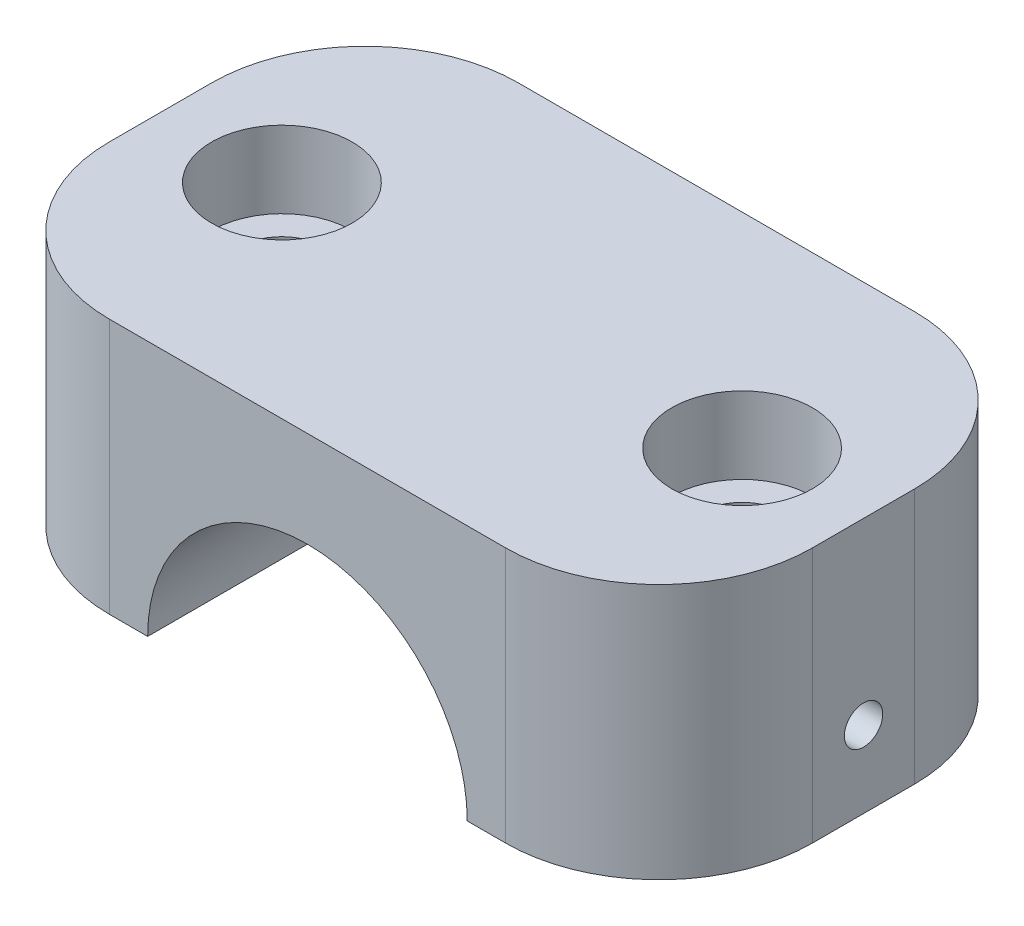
ISO-10303-21;
HEADER;
FILE_DESCRIPTION(('STEP AP214'),'2;1');
FILE_NAME('part.step','',(''),(''),'','','');
FILE_SCHEMA(('AUTOMOTIVE_DESIGN { 1 0 10303 214 1 1 1 1 }'));
ENDSEC;
DATA;
#1=APPLICATION_CONTEXT('core data for automotive mechanical design processes');
#2=APPLICATION_PROTOCOL_DEFINITION('international standard','automotive_design',2000,#1);
#3=PRODUCT_CONTEXT('',#1,'mechanical');
#4=PRODUCT('Part','Part','',(#3));
#5=PRODUCT_RELATED_PRODUCT_CATEGORY('part','',(#4));
#6=PRODUCT_DEFINITION_FORMATION('','',#4);
#7=PRODUCT_DEFINITION_CONTEXT('part definition',#1,'design');
#8=PRODUCT_DEFINITION('design','',#6,#7);
#9=PRODUCT_DEFINITION_SHAPE('','',#8);
#10=(LENGTH_UNIT() NAMED_UNIT(*) SI_UNIT(.MILLI.,.METRE.));
#11=(NAMED_UNIT(*) PLANE_ANGLE_UNIT() SI_UNIT($,.RADIAN.));
#12=(NAMED_UNIT(*) SI_UNIT($,.STERADIAN.) SOLID_ANGLE_UNIT());
#13=UNCERTAINTY_MEASURE_WITH_UNIT(LENGTH_MEASURE(1.E-05),#10,'distance_accuracy_value','');
#14=(GEOMETRIC_REPRESENTATION_CONTEXT(3) GLOBAL_UNCERTAINTY_ASSIGNED_CONTEXT((#13)) GLOBAL_UNIT_ASSIGNED_CONTEXT((#10,
#11,#12)) REPRESENTATION_CONTEXT('',''));
#15=CARTESIAN_POINT('',(0.,0.,0.));
#16=DIRECTION('',(0.,0.,1.));
#17=DIRECTION('',(1.,0.,0.));
#18=AXIS2_PLACEMENT_3D('',#15,#16,#17);
#19=CARTESIAN_POINT('',(-27.5,20.,16.));
#20=DIRECTION('',(0.,-1.,0.));
#21=DIRECTION('',(0.,0.,-1.));
#22=AXIS2_PLACEMENT_3D('',#19,#20,#21);
#23=PLANE('',#22);
#24=DIRECTION('',(-1.,0.,0.));
#25=VECTOR('',#24,1.);
#26=CARTESIAN_POINT('',(-27.5,20.,16.));
#27=LINE('',#26,#25);
#28=CARTESIAN_POINT('',(15.5,20.,16.));
#29=VERTEX_POINT('',#28);
#30=CARTESIAN_POINT('',(-15.5,20.,16.));
#31=VERTEX_POINT('',#30);
#32=EDGE_CURVE('E180',#29,#31,#27,.T.);
#33=ORIENTED_EDGE('',*,*,#32,.F.);
#34=CARTESIAN_POINT('',(15.5,20.,4.));
#35=DIRECTION('',(0.,-1.,0.));
#36=DIRECTION('',(0.,0.,-1.));
#37=AXIS2_PLACEMENT_3D('',#34,#35,#36);
#38=CIRCLE('',#37,12.);
#39=CARTESIAN_POINT('',(27.5,20.,4.));
#40=VERTEX_POINT('',#39);
#41=EDGE_CURVE('E209',#29,#40,#38,.F.);
#42=ORIENTED_EDGE('',*,*,#41,.T.);
#43=DIRECTION('',(0.,0.,-1.));
#44=VECTOR('',#43,1.);
#45=CARTESIAN_POINT('',(27.5,20.,16.));
#46=LINE('',#45,#44);
#47=CARTESIAN_POINT('',(27.5,20.,-4.));
#48=VERTEX_POINT('',#47);
#49=EDGE_CURVE('E186',#40,#48,#46,.T.);
#50=ORIENTED_EDGE('',*,*,#49,.T.);
#51=CARTESIAN_POINT('',(15.5,20.,-4.));
#52=DIRECTION('',(0.,-1.,0.));
#53=DIRECTION('',(0.,0.,-1.));
#54=AXIS2_PLACEMENT_3D('',#51,#52,#53);
#55=CIRCLE('',#54,12.);
#56=CARTESIAN_POINT('',(15.5,20.,-16.));
#57=VERTEX_POINT('',#56);
#58=EDGE_CURVE('E203',#48,#57,#55,.F.);
#59=ORIENTED_EDGE('',*,*,#58,.T.);
#60=DIRECTION('',(-1.,0.,0.));
#61=VECTOR('',#60,1.);
#62=CARTESIAN_POINT('',(-27.5,20.,-16.));
#63=LINE('',#62,#61);
#64=CARTESIAN_POINT('',(-15.5,20.,-16.));
#65=VERTEX_POINT('',#64);
#66=EDGE_CURVE('E174',#57,#65,#63,.T.);
#67=ORIENTED_EDGE('',*,*,#66,.T.);
#68=CARTESIAN_POINT('',(-15.5,20.,-4.));
#69=DIRECTION('',(0.,-1.,0.));
#70=DIRECTION('',(0.,0.,-1.));
#71=AXIS2_PLACEMENT_3D('',#68,#69,#70);
#72=CIRCLE('',#71,12.);
#73=CARTESIAN_POINT('',(-27.5,20.,-4.));
#74=VERTEX_POINT('',#73);
#75=EDGE_CURVE('E205',#65,#74,#72,.F.);
#76=ORIENTED_EDGE('',*,*,#75,.T.);
#77=DIRECTION('',(0.,0.,-1.));
#78=VECTOR('',#77,1.);
#79=CARTESIAN_POINT('',(-27.5,20.,16.));
#80=LINE('',#79,#78);
#81=CARTESIAN_POINT('',(-27.5,20.,4.));
#82=VERTEX_POINT('',#81);
#83=EDGE_CURVE('E183',#82,#74,#80,.T.);
#84=ORIENTED_EDGE('',*,*,#83,.F.);
#85=CARTESIAN_POINT('',(-15.5,20.,4.));
#86=DIRECTION('',(0.,-1.,0.));
#87=DIRECTION('',(0.,0.,-1.));
#88=AXIS2_PLACEMENT_3D('',#85,#86,#87);
#89=CIRCLE('',#88,12.);
#90=EDGE_CURVE('E207',#82,#31,#89,.F.);
#91=ORIENTED_EDGE('',*,*,#90,.T.);
#92=EDGE_LOOP('',(#33,#42,#50,#59,#67,#76,#84,#91));
#93=FACE_BOUND('',#92,.T.);
#94=CARTESIAN_POINT('',(-18.,20.,0.));
#95=DIRECTION('',(0.,1.,0.));
#96=DIRECTION('',(0.,0.,1.));
#97=AXIS2_PLACEMENT_3D('',#94,#95,#96);
#98=CIRCLE('',#97,5.49999999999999);
#99=CARTESIAN_POINT('',(-18.,20.,5.49999999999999));
#100=VERTEX_POINT('',#99);
#101=EDGE_CURVE('E159',#100,#100,#98,.T.);
#102=ORIENTED_EDGE('',*,*,#101,.F.);
#103=EDGE_LOOP('',(#102));
#104=FACE_BOUND('',#103,.T.);
#105=CARTESIAN_POINT('',(18.,20.,0.));
#106=DIRECTION('',(0.,1.,0.));
#107=DIRECTION('',(0.,0.,1.));
#108=AXIS2_PLACEMENT_3D('',#105,#106,#107);
#109=CIRCLE('',#108,5.49999999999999);
#110=CARTESIAN_POINT('',(18.,20.,5.49999999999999));
#111=VERTEX_POINT('',#110);
#112=EDGE_CURVE('E141',#111,#111,#109,.T.);
#113=ORIENTED_EDGE('',*,*,#112,.F.);
#114=EDGE_LOOP('',(#113));
#115=FACE_BOUND('',#114,.T.);
#116=ADVANCED_FACE('F38',(#93,#104,#115),#23,.F.);
#117=CARTESIAN_POINT('',(-27.5,0.,16.));
#118=DIRECTION('',(0.,1.,0.));
#119=DIRECTION('',(0.,0.,1.));
#120=AXIS2_PLACEMENT_3D('',#117,#118,#119);
#121=PLANE('',#120);
#122=CARTESIAN_POINT('',(18.,0.,0.));
#123=DIRECTION('',(0.,1.,0.));
#124=DIRECTION('',(0.,0.,1.));
#125=AXIS2_PLACEMENT_3D('',#122,#123,#124);
#126=CIRCLE('',#125,3.29999999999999);
#127=CARTESIAN_POINT('',(18.,0.,3.29999999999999));
#128=VERTEX_POINT('',#127);
#129=EDGE_CURVE('E130',#128,#128,#126,.T.);
#130=ORIENTED_EDGE('',*,*,#129,.T.);
#131=EDGE_LOOP('',(#130));
#132=FACE_BOUND('',#131,.T.);
#133=DIRECTION('',(0.,0.,-1.));
#134=VECTOR('',#133,1.);
#135=CARTESIAN_POINT('',(27.5,0.,16.));
#136=LINE('',#135,#134);
#137=CARTESIAN_POINT('',(27.5,0.,4.));
#138=VERTEX_POINT('',#137);
#139=CARTESIAN_POINT('',(27.5,0.,-4.));
#140=VERTEX_POINT('',#139);
#141=EDGE_CURVE('E189',#138,#140,#136,.T.);
#142=ORIENTED_EDGE('',*,*,#141,.F.);
#143=CARTESIAN_POINT('',(15.5,0.,4.));
#144=DIRECTION('',(0.,1.,0.));
#145=DIRECTION('',(0.,0.,1.));
#146=AXIS2_PLACEMENT_3D('',#143,#144,#145);
#147=CIRCLE('',#146,12.);
#148=CARTESIAN_POINT('',(15.5,0.,16.));
#149=VERTEX_POINT('',#148);
#150=EDGE_CURVE('E218',#138,#149,#147,.F.);
#151=ORIENTED_EDGE('',*,*,#150,.T.);
#152=DIRECTION('',(1.,0.,0.));
#153=VECTOR('',#152,1.);
#154=CARTESIAN_POINT('',(-27.5,0.,16.));
#155=LINE('',#154,#153);
#156=CARTESIAN_POINT('',(12.5,0.,16.));
#157=VERTEX_POINT('',#156);
#158=EDGE_CURVE('E177',#157,#149,#155,.T.);
#159=ORIENTED_EDGE('',*,*,#158,.F.);
#160=DIRECTION('',(0.,0.,-1.));
#161=VECTOR('',#160,1.);
#162=CARTESIAN_POINT('',(12.5,0.,139.376030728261));
#163=LINE('',#162,#161);
#164=CARTESIAN_POINT('',(12.5,0.,-16.));
#165=VERTEX_POINT('',#164);
#166=EDGE_CURVE('E162',#157,#165,#163,.T.);
#167=ORIENTED_EDGE('',*,*,#166,.T.);
#168=DIRECTION('',(1.,0.,0.));
#169=VECTOR('',#168,1.);
#170=CARTESIAN_POINT('',(-27.5,0.,-16.));
#171=LINE('',#170,#169);
#172=CARTESIAN_POINT('',(15.5,0.,-16.));
#173=VERTEX_POINT('',#172);
#174=EDGE_CURVE('E171',#165,#173,#171,.T.);
#175=ORIENTED_EDGE('',*,*,#174,.T.);
#176=CARTESIAN_POINT('',(15.5,0.,-4.));
#177=DIRECTION('',(0.,1.,0.));
#178=DIRECTION('',(0.,0.,1.));
#179=AXIS2_PLACEMENT_3D('',#176,#177,#178);
#180=CIRCLE('',#179,12.);
#181=EDGE_CURVE('E216',#173,#140,#180,.F.);
#182=ORIENTED_EDGE('',*,*,#181,.T.);
#183=EDGE_LOOP('',(#142,#151,#159,#167,#175,#182));
#184=FACE_BOUND('',#183,.T.);
#185=ADVANCED_FACE('F236',(#132,#184),#121,.F.);
#186=CARTESIAN_POINT('',(-18.,0.,0.));
#187=DIRECTION('',(0.,1.,0.));
#188=DIRECTION('',(0.,0.,1.));
#189=AXIS2_PLACEMENT_3D('',#186,#187,#188);
#190=CIRCLE('',#189,3.3);
#191=CARTESIAN_POINT('',(-18.,0.,3.3));
#192=VERTEX_POINT('',#191);
#193=EDGE_CURVE('E150',#192,#192,#190,.T.);
#194=ORIENTED_EDGE('',*,*,#193,.T.);
#195=EDGE_LOOP('',(#194));
#196=FACE_BOUND('',#195,.T.);
#197=CARTESIAN_POINT('',(-15.5,0.,16.));
#198=VERTEX_POINT('',#197);
#199=CARTESIAN_POINT('',(-12.5,0.,16.));
#200=VERTEX_POINT('',#199);
#201=EDGE_CURVE('E178',#198,#200,#155,.T.);
#202=ORIENTED_EDGE('',*,*,#201,.F.);
#203=CARTESIAN_POINT('',(-15.5,0.,4.));
#204=DIRECTION('',(0.,1.,0.));
#205=DIRECTION('',(0.,0.,1.));
#206=AXIS2_PLACEMENT_3D('',#203,#204,#205);
#207=CIRCLE('',#206,12.);
#208=CARTESIAN_POINT('',(-27.5,0.,4.));
#209=VERTEX_POINT('',#208);
#210=EDGE_CURVE('E221',#198,#209,#207,.F.);
#211=ORIENTED_EDGE('',*,*,#210,.T.);
#212=DIRECTION('',(0.,0.,-1.));
#213=VECTOR('',#212,1.);
#214=CARTESIAN_POINT('',(-27.5,0.,16.));
#215=LINE('',#214,#213);
#216=CARTESIAN_POINT('',(-27.5,0.,-4.));
#217=VERTEX_POINT('',#216);
#218=EDGE_CURVE('E192',#209,#217,#215,.T.);
#219=ORIENTED_EDGE('',*,*,#218,.T.);
#220=CARTESIAN_POINT('',(-15.5,0.,-4.));
#221=DIRECTION('',(0.,1.,0.));
#222=DIRECTION('',(0.,0.,1.));
#223=AXIS2_PLACEMENT_3D('',#220,#221,#222);
#224=CIRCLE('',#223,12.);
#225=CARTESIAN_POINT('',(-15.5,0.,-16.));
#226=VERTEX_POINT('',#225);
#227=EDGE_CURVE('E53',#217,#226,#224,.F.);
#228=ORIENTED_EDGE('',*,*,#227,.T.);
#229=CARTESIAN_POINT('',(-12.5,0.,-16.));
#230=VERTEX_POINT('',#229);
#231=EDGE_CURVE('E172',#226,#230,#171,.T.);
#232=ORIENTED_EDGE('',*,*,#231,.T.);
#233=DIRECTION('',(0.,0.,-1.));
#234=VECTOR('',#233,1.);
#235=CARTESIAN_POINT('',(-12.5,0.,139.376030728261));
#236=LINE('',#235,#234);
#237=EDGE_CURVE('E163',#200,#230,#236,.T.);
#238=ORIENTED_EDGE('',*,*,#237,.F.);
#239=EDGE_LOOP('',(#202,#211,#219,#228,#232,#238));
#240=FACE_BOUND('',#239,.T.);
#241=ADVANCED_FACE('F260',(#196,#240),#121,.F.);
#242=CARTESIAN_POINT('',(-27.5,20.,16.));
#243=DIRECTION('',(0.,0.,-1.));
#244=DIRECTION('',(-1.,0.,0.));
#245=AXIS2_PLACEMENT_3D('',#242,#243,#244);
#246=PLANE('',#245);
#247=ORIENTED_EDGE('',*,*,#158,.T.);
#248=DIRECTION('',(0.,1.,0.));
#249=VECTOR('',#248,1.);
#250=CARTESIAN_POINT('',(15.5,20.,16.));
#251=LINE('',#250,#249);
#252=EDGE_CURVE('E200',#149,#29,#251,.T.);
#253=ORIENTED_EDGE('',*,*,#252,.T.);
#254=ORIENTED_EDGE('',*,*,#32,.T.);
#255=DIRECTION('',(0.,-1.,0.));
#256=VECTOR('',#255,1.);
#257=CARTESIAN_POINT('',(-15.5,20.,16.));
#258=LINE('',#257,#256);
#259=EDGE_CURVE('E197',#31,#198,#258,.T.);
#260=ORIENTED_EDGE('',*,*,#259,.T.);
#261=ORIENTED_EDGE('',*,*,#201,.T.);
#262=CARTESIAN_POINT('',(0.,0.,16.));
#263=DIRECTION('',(0.,0.,-1.));
#264=DIRECTION('',(-1.,0.,0.));
#265=AXIS2_PLACEMENT_3D('',#262,#263,#264);
#266=CIRCLE('',#265,12.5);
#267=EDGE_CURVE('E166',#157,#200,#266,.F.);
#268=ORIENTED_EDGE('',*,*,#267,.F.);
#269=EDGE_LOOP('',(#247,#253,#254,#260,#261,#268));
#270=FACE_BOUND('',#269,.T.);
#271=ADVANCED_FACE('F253',(#270),#246,.F.);
#272=CARTESIAN_POINT('',(-27.5,20.,-16.));
#273=DIRECTION('',(0.,0.,-1.));
#274=DIRECTION('',(-1.,0.,0.));
#275=AXIS2_PLACEMENT_3D('',#272,#273,#274);
#276=PLANE('',#275);
#277=ORIENTED_EDGE('',*,*,#231,.F.);
#278=DIRECTION('',(0.,-1.,0.));
#279=VECTOR('',#278,1.);
#280=CARTESIAN_POINT('',(-15.5,20.,-16.));
#281=LINE('',#280,#279);
#282=EDGE_CURVE('E11',#226,#65,#281,.F.);
#283=ORIENTED_EDGE('',*,*,#282,.T.);
#284=ORIENTED_EDGE('',*,*,#66,.F.);
#285=DIRECTION('',(0.,1.,0.));
#286=VECTOR('',#285,1.);
#287=CARTESIAN_POINT('',(15.5,0.,-16.));
#288=LINE('',#287,#286);
#289=EDGE_CURVE('E46',#57,#173,#288,.F.);
#290=ORIENTED_EDGE('',*,*,#289,.T.);
#291=ORIENTED_EDGE('',*,*,#174,.F.);
#292=CARTESIAN_POINT('',(0.,0.,-16.));
#293=DIRECTION('',(0.,0.,-1.));
#294=DIRECTION('',(-1.,0.,0.));
#295=AXIS2_PLACEMENT_3D('',#292,#293,#294);
#296=CIRCLE('',#295,12.5);
#297=EDGE_CURVE('E194',#165,#230,#296,.F.);
#298=ORIENTED_EDGE('',*,*,#297,.T.);
#299=EDGE_LOOP('',(#277,#283,#284,#290,#291,#298));
#300=FACE_BOUND('',#299,.T.);
#301=ADVANCED_FACE('F231',(#300),#276,.T.);
#302=CARTESIAN_POINT('',(-27.5,0.,16.));
#303=DIRECTION('',(1.,0.,0.));
#304=DIRECTION('',(0.,1.,0.));
#305=AXIS2_PLACEMENT_3D('',#302,#303,#304);
#306=PLANE('',#305);
#307=CARTESIAN_POINT('',(-27.5,6.,0.));
#308=DIRECTION('',(-1.,0.,0.));
#309=DIRECTION('',(0.,0.,1.));
#310=AXIS2_PLACEMENT_3D('',#307,#308,#309);
#311=CIRCLE('',#310,1.5);
#312=CARTESIAN_POINT('',(-27.5,6.,1.5));
#313=VERTEX_POINT('',#312);
#314=EDGE_CURVE('E127',#313,#313,#311,.T.);
#315=ORIENTED_EDGE('',*,*,#314,.F.);
#316=EDGE_LOOP('',(#315));
#317=FACE_BOUND('',#316,.T.);
#318=ORIENTED_EDGE('',*,*,#218,.F.);
#319=DIRECTION('',(0.,-1.,0.));
#320=VECTOR('',#319,1.);
#321=CARTESIAN_POINT('',(-27.5,0.,4.));
#322=LINE('',#321,#320);
#323=EDGE_CURVE('E225',#209,#82,#322,.F.);
#324=ORIENTED_EDGE('',*,*,#323,.T.);
#325=ORIENTED_EDGE('',*,*,#83,.T.);
#326=DIRECTION('',(0.,-1.,0.));
#327=VECTOR('',#326,1.);
#328=CARTESIAN_POINT('',(-27.5,0.,-4.));
#329=LINE('',#328,#327);
#330=EDGE_CURVE('E223',#74,#217,#329,.T.);
#331=ORIENTED_EDGE('',*,*,#330,.T.);
#332=EDGE_LOOP('',(#318,#324,#325,#331));
#333=FACE_BOUND('',#332,.T.);
#334=ADVANCED_FACE('F40',(#317,#333),#306,.F.);
#335=CARTESIAN_POINT('',(27.5,0.,16.));
#336=DIRECTION('',(-1.,0.,0.));
#337=DIRECTION('',(0.,0.,1.));
#338=AXIS2_PLACEMENT_3D('',#335,#336,#337);
#339=PLANE('',#338);
#340=CARTESIAN_POINT('',(27.5,6.,0.));
#341=DIRECTION('',(1.,0.,0.));
#342=DIRECTION('',(0.,0.,-1.));
#343=AXIS2_PLACEMENT_3D('',#340,#341,#342);
#344=CIRCLE('',#343,1.5);
#345=CARTESIAN_POINT('',(27.5,6.,-1.5));
#346=VERTEX_POINT('',#345);
#347=EDGE_CURVE('E147',#346,#346,#344,.T.);
#348=ORIENTED_EDGE('',*,*,#347,.F.);
#349=EDGE_LOOP('',(#348));
#350=FACE_BOUND('',#349,.T.);
#351=ORIENTED_EDGE('',*,*,#49,.F.);
#352=DIRECTION('',(0.,1.,0.));
#353=VECTOR('',#352,1.);
#354=CARTESIAN_POINT('',(27.5,0.,4.));
#355=LINE('',#354,#353);
#356=EDGE_CURVE('E214',#40,#138,#355,.F.);
#357=ORIENTED_EDGE('',*,*,#356,.T.);
#358=ORIENTED_EDGE('',*,*,#141,.T.);
#359=DIRECTION('',(0.,1.,0.));
#360=VECTOR('',#359,1.);
#361=CARTESIAN_POINT('',(27.5,20.,-4.));
#362=LINE('',#361,#360);
#363=EDGE_CURVE('E211',#140,#48,#362,.T.);
#364=ORIENTED_EDGE('',*,*,#363,.T.);
#365=EDGE_LOOP('',(#351,#357,#358,#364));
#366=FACE_BOUND('',#365,.T.);
#367=ADVANCED_FACE('F242',(#350,#366),#339,.F.);
#368=CARTESIAN_POINT('',(0.,0.,139.376030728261));
#369=DIRECTION('',(0.,0.,-1.));
#370=DIRECTION('',(-1.,0.,0.));
#371=AXIS2_PLACEMENT_3D('',#368,#369,#370);
#372=CYLINDRICAL_SURFACE('',#371,12.5);
#373=ORIENTED_EDGE('',*,*,#166,.F.);
#374=ORIENTED_EDGE('',*,*,#267,.T.);
#375=ORIENTED_EDGE('',*,*,#237,.T.);
#376=ORIENTED_EDGE('',*,*,#297,.F.);
#377=EDGE_LOOP('',(#373,#374,#375,#376));
#378=FACE_BOUND('',#377,.T.);
#379=ADVANCED_FACE('F259',(#378),#372,.F.);
#380=CARTESIAN_POINT('',(15.5,20.,4.));
#381=DIRECTION('',(0.,1.,0.));
#382=DIRECTION('',(0.,0.,1.));
#383=AXIS2_PLACEMENT_3D('',#380,#381,#382);
#384=CYLINDRICAL_SURFACE('',#383,12.);
#385=ORIENTED_EDGE('',*,*,#150,.F.);
#386=ORIENTED_EDGE('',*,*,#356,.F.);
#387=ORIENTED_EDGE('',*,*,#41,.F.);
#388=ORIENTED_EDGE('',*,*,#252,.F.);
#389=EDGE_LOOP('',(#385,#386,#387,#388));
#390=FACE_BOUND('',#389,.T.);
#391=ADVANCED_FACE('F250',(#390),#384,.T.);
#392=CARTESIAN_POINT('',(-15.5,20.,4.));
#393=DIRECTION('',(0.,-1.,0.));
#394=DIRECTION('',(1.,0.,0.));
#395=AXIS2_PLACEMENT_3D('',#392,#393,#394);
#396=CYLINDRICAL_SURFACE('',#395,12.);
#397=ORIENTED_EDGE('',*,*,#90,.F.);
#398=ORIENTED_EDGE('',*,*,#323,.F.);
#399=ORIENTED_EDGE('',*,*,#210,.F.);
#400=ORIENTED_EDGE('',*,*,#259,.F.);
#401=EDGE_LOOP('',(#397,#398,#399,#400));
#402=FACE_BOUND('',#401,.T.);
#403=ADVANCED_FACE('F269',(#402),#396,.T.);
#404=CARTESIAN_POINT('',(-15.5,0.,-4.));
#405=DIRECTION('',(0.,1.,0.));
#406=DIRECTION('',(-1.,0.,0.));
#407=AXIS2_PLACEMENT_3D('',#404,#405,#406);
#408=CYLINDRICAL_SURFACE('',#407,12.);
#409=ORIENTED_EDGE('',*,*,#75,.F.);
#410=ORIENTED_EDGE('',*,*,#282,.F.);
#411=ORIENTED_EDGE('',*,*,#227,.F.);
#412=ORIENTED_EDGE('',*,*,#330,.F.);
#413=EDGE_LOOP('',(#409,#410,#411,#412));
#414=FACE_BOUND('',#413,.T.);
#415=ADVANCED_FACE('F262',(#414),#408,.T.);
#416=CARTESIAN_POINT('',(15.5,0.,-4.));
#417=DIRECTION('',(0.,-1.,0.));
#418=DIRECTION('',(0.,0.,-1.));
#419=AXIS2_PLACEMENT_3D('',#416,#417,#418);
#420=CYLINDRICAL_SURFACE('',#419,12.);
#421=ORIENTED_EDGE('',*,*,#181,.F.);
#422=ORIENTED_EDGE('',*,*,#289,.F.);
#423=ORIENTED_EDGE('',*,*,#58,.F.);
#424=ORIENTED_EDGE('',*,*,#363,.F.);
#425=EDGE_LOOP('',(#421,#422,#423,#424));
#426=FACE_BOUND('',#425,.T.);
#427=ADVANCED_FACE('F239',(#426),#420,.T.);
#428=CARTESIAN_POINT('',(-18.,20.,0.));
#429=DIRECTION('',(0.,1.,0.));
#430=DIRECTION('',(0.,0.,1.));
#431=AXIS2_PLACEMENT_3D('',#428,#429,#430);
#432=CYLINDRICAL_SURFACE('',#431,5.49999999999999);
#433=CARTESIAN_POINT('',(-18.,14.,0.));
#434=DIRECTION('',(0.,1.,0.));
#435=DIRECTION('',(0.,0.,1.));
#436=AXIS2_PLACEMENT_3D('',#433,#434,#435);
#437=CIRCLE('',#436,5.49999999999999);
#438=CARTESIAN_POINT('',(-18.,14.,5.49999999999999));
#439=VERTEX_POINT('',#438);
#440=EDGE_CURVE('E156',#439,#439,#437,.T.);
#441=ORIENTED_EDGE('',*,*,#440,.F.);
#442=EDGE_LOOP('',(#441));
#443=FACE_BOUND('',#442,.T.);
#444=ORIENTED_EDGE('',*,*,#101,.T.);
#445=EDGE_LOOP('',(#444));
#446=FACE_BOUND('',#445,.T.);
#447=ADVANCED_FACE('F318',(#443,#446),#432,.F.);
#448=CARTESIAN_POINT('',(-14.7,14.,0.));
#449=DIRECTION('',(0.,-1.,0.));
#450=DIRECTION('',(0.,0.,-1.));
#451=AXIS2_PLACEMENT_3D('',#448,#449,#450);
#452=PLANE('',#451);
#453=CARTESIAN_POINT('',(-18.,14.,0.));
#454=DIRECTION('',(0.,1.,0.));
#455=DIRECTION('',(0.,0.,1.));
#456=AXIS2_PLACEMENT_3D('',#453,#454,#455);
#457=CIRCLE('',#456,3.30000000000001);
#458=CARTESIAN_POINT('',(-18.,14.,3.30000000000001));
#459=VERTEX_POINT('',#458);
#460=EDGE_CURVE('E153',#459,#459,#457,.T.);
#461=ORIENTED_EDGE('',*,*,#460,.F.);
#462=EDGE_LOOP('',(#461));
#463=FACE_BOUND('',#462,.T.);
#464=ORIENTED_EDGE('',*,*,#440,.T.);
#465=EDGE_LOOP('',(#464));
#466=FACE_BOUND('',#465,.T.);
#467=ADVANCED_FACE('F310',(#463,#466),#452,.F.);
#468=CARTESIAN_POINT('',(-18.,20.,0.));
#469=DIRECTION('',(0.,1.,0.));
#470=DIRECTION('',(0.,0.,1.));
#471=AXIS2_PLACEMENT_3D('',#468,#469,#470);
#472=CYLINDRICAL_SURFACE('',#471,3.3);
#473=ORIENTED_EDGE('',*,*,#193,.F.);
#474=EDGE_LOOP('',(#473));
#475=FACE_BOUND('',#474,.T.);
#476=ORIENTED_EDGE('',*,*,#460,.T.);
#477=EDGE_LOOP('',(#476));
#478=FACE_BOUND('',#477,.T.);
#479=ADVANCED_FACE('F300',(#475,#478),#472,.F.);
#480=CARTESIAN_POINT('',(27.5,6.,0.));
#481=DIRECTION('',(1.,0.,0.));
#482=DIRECTION('',(0.,0.,-1.));
#483=AXIS2_PLACEMENT_3D('',#480,#481,#482);
#484=CYLINDRICAL_SURFACE('',#483,1.5);
#485=CARTESIAN_POINT('',(23.5,6.,0.));
#486=DIRECTION('',(1.,0.,0.));
#487=DIRECTION('',(0.,0.,-1.));
#488=AXIS2_PLACEMENT_3D('',#485,#486,#487);
#489=CIRCLE('',#488,1.5);
#490=CARTESIAN_POINT('',(23.5,6.,-1.5));
#491=VERTEX_POINT('',#490);
#492=EDGE_CURVE('E144',#491,#491,#489,.T.);
#493=ORIENTED_EDGE('',*,*,#492,.F.);
#494=EDGE_LOOP('',(#493));
#495=FACE_BOUND('',#494,.T.);
#496=ORIENTED_EDGE('',*,*,#347,.T.);
#497=EDGE_LOOP('',(#496));
#498=FACE_BOUND('',#497,.T.);
#499=ADVANCED_FACE('F297',(#495,#498),#484,.F.);
#500=CARTESIAN_POINT('',(23.5,6.,0.));
#501=DIRECTION('',(1.,0.,0.));
#502=DIRECTION('',(0.,0.,-1.));
#503=AXIS2_PLACEMENT_3D('',#500,#501,#502);
#504=CONICAL_SURFACE('',#503,1.5,1.02974425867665);
#505=CARTESIAN_POINT('',(22.5987090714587,6.,0.));
#506=VERTEX_POINT('',#505);
#507=VERTEX_LOOP('',#506);
#508=FACE_BOUND('',#507,.T.);
#509=ORIENTED_EDGE('',*,*,#492,.T.);
#510=EDGE_LOOP('',(#509));
#511=FACE_BOUND('',#510,.T.);
#512=ADVANCED_FACE('F299',(#508,#511),#504,.F.);
#513=CARTESIAN_POINT('',(18.,20.,0.));
#514=DIRECTION('',(0.,1.,0.));
#515=DIRECTION('',(0.,0.,1.));
#516=AXIS2_PLACEMENT_3D('',#513,#514,#515);
#517=CYLINDRICAL_SURFACE('',#516,5.49999999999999);
#518=CARTESIAN_POINT('',(18.,14.,0.));
#519=DIRECTION('',(0.,1.,0.));
#520=DIRECTION('',(0.,0.,1.));
#521=AXIS2_PLACEMENT_3D('',#518,#519,#520);
#522=CIRCLE('',#521,5.49999999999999);
#523=CARTESIAN_POINT('',(18.,14.,5.49999999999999));
#524=VERTEX_POINT('',#523);
#525=EDGE_CURVE('E138',#524,#524,#522,.T.);
#526=ORIENTED_EDGE('',*,*,#525,.F.);
#527=EDGE_LOOP('',(#526));
#528=FACE_BOUND('',#527,.T.);
#529=ORIENTED_EDGE('',*,*,#112,.T.);
#530=EDGE_LOOP('',(#529));
#531=FACE_BOUND('',#530,.T.);
#532=ADVANCED_FACE('F307',(#528,#531),#517,.F.);
#533=CARTESIAN_POINT('',(21.3,14.,0.));
#534=DIRECTION('',(0.,-1.,0.));
#535=DIRECTION('',(0.,0.,-1.));
#536=AXIS2_PLACEMENT_3D('',#533,#534,#535);
#537=PLANE('',#536);
#538=CARTESIAN_POINT('',(18.,14.,0.));
#539=DIRECTION('',(0.,1.,0.));
#540=DIRECTION('',(0.,0.,1.));
#541=AXIS2_PLACEMENT_3D('',#538,#539,#540);
#542=CIRCLE('',#541,3.30000000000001);
#543=CARTESIAN_POINT('',(18.,14.,3.30000000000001));
#544=VERTEX_POINT('',#543);
#545=EDGE_CURVE('E135',#544,#544,#542,.T.);
#546=ORIENTED_EDGE('',*,*,#545,.F.);
#547=EDGE_LOOP('',(#546));
#548=FACE_BOUND('',#547,.T.);
#549=ORIENTED_EDGE('',*,*,#525,.T.);
#550=EDGE_LOOP('',(#549));
#551=FACE_BOUND('',#550,.T.);
#552=ADVANCED_FACE('F385',(#548,#551),#537,.F.);
#553=CARTESIAN_POINT('',(18.,20.,0.));
#554=DIRECTION('',(0.,1.,0.));
#555=DIRECTION('',(0.,0.,1.));
#556=AXIS2_PLACEMENT_3D('',#553,#554,#555);
#557=CYLINDRICAL_SURFACE('',#556,3.3);
#558=ORIENTED_EDGE('',*,*,#129,.F.);
#559=EDGE_LOOP('',(#558));
#560=FACE_BOUND('',#559,.T.);
#561=ORIENTED_EDGE('',*,*,#545,.T.);
#562=EDGE_LOOP('',(#561));
#563=FACE_BOUND('',#562,.T.);
#564=ADVANCED_FACE('F394',(#560,#563),#557,.F.);
#565=CARTESIAN_POINT('',(-27.5,6.,0.));
#566=DIRECTION('',(-1.,0.,0.));
#567=DIRECTION('',(0.,0.,1.));
#568=AXIS2_PLACEMENT_3D('',#565,#566,#567);
#569=CYLINDRICAL_SURFACE('',#568,1.5);
#570=CARTESIAN_POINT('',(-23.5,6.,0.));
#571=DIRECTION('',(-1.,0.,0.));
#572=DIRECTION('',(0.,0.,1.));
#573=AXIS2_PLACEMENT_3D('',#570,#571,#572);
#574=CIRCLE('',#573,1.5);
#575=CARTESIAN_POINT('',(-23.5,6.,1.5));
#576=VERTEX_POINT('',#575);
#577=EDGE_CURVE('E125',#576,#576,#574,.T.);
#578=ORIENTED_EDGE('',*,*,#577,.F.);
#579=EDGE_LOOP('',(#578));
#580=FACE_BOUND('',#579,.T.);
#581=ORIENTED_EDGE('',*,*,#314,.T.);
#582=EDGE_LOOP('',(#581));
#583=FACE_BOUND('',#582,.T.);
#584=ADVANCED_FACE('F121',(#580,#583),#569,.F.);
#585=CARTESIAN_POINT('',(-23.5,6.,0.));
#586=DIRECTION('',(-1.,0.,0.));
#587=DIRECTION('',(0.,0.,1.));
#588=AXIS2_PLACEMENT_3D('',#585,#586,#587);
#589=CONICAL_SURFACE('',#588,1.5,1.02974425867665);
#590=CARTESIAN_POINT('',(-22.5987090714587,6.,0.));
#591=VERTEX_POINT('',#590);
#592=VERTEX_LOOP('',#591);
#593=FACE_BOUND('',#592,.T.);
#594=ORIENTED_EDGE('',*,*,#577,.T.);
#595=EDGE_LOOP('',(#594));
#596=FACE_BOUND('',#595,.T.);
#597=ADVANCED_FACE('F118',(#593,#596),#589,.F.);
#598=CLOSED_SHELL('',(#116,#185,#241,#271,#301,#334,#367,#379,#391,#403,#415,#427,#447,#467,
#479,#499,#512,#532,#552,#564,#584,#597));
#599=MANIFOLD_SOLID_BREP('B2',#598);
#600=ADVANCED_BREP_SHAPE_REPRESENTATION('',(#18,#599),#14);
#601=SHAPE_DEFINITION_REPRESENTATION(#9,#600);
ENDSEC;
END-ISO-10303-21;
